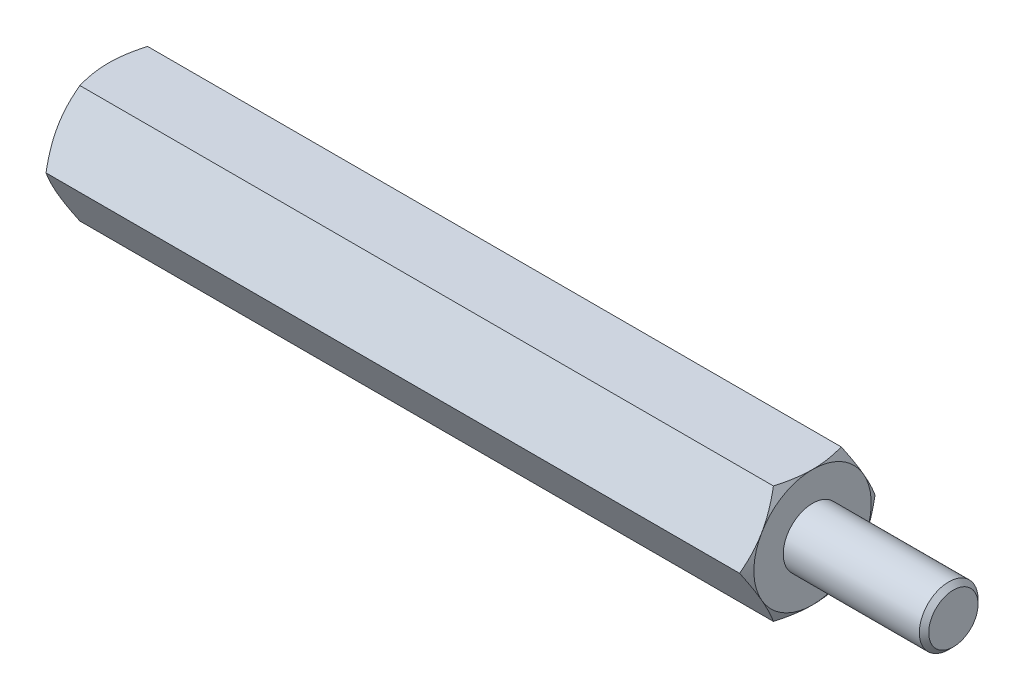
ISO-10303-21;
HEADER;
FILE_DESCRIPTION(('STEP AP214'),'2;1');
FILE_NAME('part.step','',(''),(''),'','','');
FILE_SCHEMA(('AUTOMOTIVE_DESIGN { 1 0 10303 214 1 1 1 1 }'));
ENDSEC;
DATA;
#1=APPLICATION_CONTEXT('core data for automotive mechanical design processes');
#2=APPLICATION_PROTOCOL_DEFINITION('international standard','automotive_design',2000,#1);
#3=PRODUCT_CONTEXT('',#1,'mechanical');
#4=PRODUCT('Part','Part','',(#3));
#5=PRODUCT_RELATED_PRODUCT_CATEGORY('part','',(#4));
#6=PRODUCT_DEFINITION_FORMATION('','',#4);
#7=PRODUCT_DEFINITION_CONTEXT('part definition',#1,'design');
#8=PRODUCT_DEFINITION('design','',#6,#7);
#9=PRODUCT_DEFINITION_SHAPE('','',#8);
#10=(LENGTH_UNIT() NAMED_UNIT(*) SI_UNIT(.MILLI.,.METRE.));
#11=(NAMED_UNIT(*) PLANE_ANGLE_UNIT() SI_UNIT($,.RADIAN.));
#12=(NAMED_UNIT(*) SI_UNIT($,.STERADIAN.) SOLID_ANGLE_UNIT());
#13=UNCERTAINTY_MEASURE_WITH_UNIT(LENGTH_MEASURE(1.E-05),#10,'distance_accuracy_value','');
#14=(GEOMETRIC_REPRESENTATION_CONTEXT(3) GLOBAL_UNCERTAINTY_ASSIGNED_CONTEXT((#13)) GLOBAL_UNIT_ASSIGNED_CONTEXT((#10,
#11,#12)) REPRESENTATION_CONTEXT('',''));
#15=CARTESIAN_POINT('',(0.,0.,0.));
#16=DIRECTION('',(0.,0.,1.));
#17=DIRECTION('',(1.,0.,0.));
#18=AXIS2_PLACEMENT_3D('',#15,#16,#17);
#19=CARTESIAN_POINT('',(15.,2.5,-1.44337567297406));
#20=DIRECTION('',(1.,0.,0.));
#21=DIRECTION('',(0.,0.,-1.));
#22=AXIS2_PLACEMENT_3D('',#19,#20,#21);
#23=PLANE('',#22);
#24=CARTESIAN_POINT('',(15.,0.,0.));
#25=DIRECTION('',(1.,0.,0.));
#26=DIRECTION('',(0.,0.,-1.));
#27=AXIS2_PLACEMENT_3D('',#24,#25,#26);
#28=CIRCLE('',#27,2.5);
#29=CARTESIAN_POINT('',(15.,-1.25,-2.1650635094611));
#30=VERTEX_POINT('',#29);
#31=CARTESIAN_POINT('',(15.,1.25,-2.1650635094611));
#32=VERTEX_POINT('',#31);
#33=EDGE_CURVE('E288',#30,#32,#28,.T.);
#34=ORIENTED_EDGE('',*,*,#33,.T.);
#35=CARTESIAN_POINT('',(15.,2.5,0.));
#36=VERTEX_POINT('',#35);
#37=EDGE_CURVE('E53',#32,#36,#28,.T.);
#38=ORIENTED_EDGE('',*,*,#37,.T.);
#39=CARTESIAN_POINT('',(15.,1.25,2.1650635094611));
#40=VERTEX_POINT('',#39);
#41=EDGE_CURVE('E297',#36,#40,#28,.T.);
#42=ORIENTED_EDGE('',*,*,#41,.T.);
#43=CARTESIAN_POINT('',(15.,-1.25000000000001,2.1650635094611));
#44=VERTEX_POINT('',#43);
#45=EDGE_CURVE('E302',#40,#44,#28,.T.);
#46=ORIENTED_EDGE('',*,*,#45,.T.);
#47=CARTESIAN_POINT('',(15.,0.,0.));
#48=DIRECTION('',(-1.,0.,0.));
#49=DIRECTION('',(0.,-1.,0.));
#50=AXIS2_PLACEMENT_3D('',#47,#48,#49);
#51=CIRCLE('',#50,2.5);
#52=CARTESIAN_POINT('',(15.,-2.50000000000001,0.));
#53=VERTEX_POINT('',#52);
#54=EDGE_CURVE('E193',#53,#44,#51,.T.);
#55=ORIENTED_EDGE('',*,*,#54,.F.);
#56=EDGE_CURVE('E61',#53,#30,#28,.T.);
#57=ORIENTED_EDGE('',*,*,#56,.T.);
#58=EDGE_LOOP('',(#34,#38,#42,#46,#55,#57));
#59=FACE_BOUND('',#58,.T.);
#60=CARTESIAN_POINT('',(15.,0.,0.));
#61=DIRECTION('',(1.,0.,0.));
#62=DIRECTION('',(0.,0.,-1.));
#63=AXIS2_PLACEMENT_3D('',#60,#61,#62);
#64=CIRCLE('',#63,1.25);
#65=CARTESIAN_POINT('',(15.,0.,-1.25));
#66=VERTEX_POINT('',#65);
#67=EDGE_CURVE('E319',#66,#66,#64,.T.);
#68=ORIENTED_EDGE('',*,*,#67,.F.);
#69=EDGE_LOOP('',(#68));
#70=FACE_BOUND('',#69,.T.);
#71=ADVANCED_FACE('F37',(#59,#70),#23,.T.);
#72=CARTESIAN_POINT('',(15.,0.,-2.88675134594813));
#73=DIRECTION('',(0.,-0.5,0.866025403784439));
#74=DIRECTION('',(0.,-0.866025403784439,-0.5));
#75=AXIS2_PLACEMENT_3D('',#72,#73,#74);
#76=PLANE('',#75);
#77=CARTESIAN_POINT('',(14.7766423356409,-0.000199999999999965,-2.88686681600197));
#78=CARTESIAN_POINT('',(14.8132783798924,0.109663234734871,-2.82343724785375));
#79=CARTESIAN_POINT('',(14.8465977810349,0.220474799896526,-2.75946016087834));
#80=CARTESIAN_POINT('',(14.9047577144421,0.444016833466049,-2.63039810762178));
#81=CARTESIAN_POINT('',(14.9295776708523,0.556751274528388,-2.5653108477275));
#82=CARTESIAN_POINT('',(14.968214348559,0.780822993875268,-2.43594298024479));
#83=CARTESIAN_POINT('',(14.9822882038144,0.892125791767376,-2.37168227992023));
#84=CARTESIAN_POINT('',(14.9990908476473,1.11525522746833,-2.24285844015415));
#85=CARTESIAN_POINT('',(15.0018335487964,1.22708105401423,-2.17829576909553));
#86=CARTESIAN_POINT('',(14.9961342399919,1.43604197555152,-2.05765212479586));
#87=CARTESIAN_POINT('',(14.9890916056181,1.53320831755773,-2.0015531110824));
#88=CARTESIAN_POINT('',(14.9667685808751,1.726907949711,-1.88972057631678));
#89=CARTESIAN_POINT('',(14.9514805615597,1.82344056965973,-1.8339874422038));
#90=CARTESIAN_POINT('',(14.9132609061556,2.01753972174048,-1.7219242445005));
#91=CARTESIAN_POINT('',(14.8901672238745,2.11508168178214,-1.66560836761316));
#92=CARTESIAN_POINT('',(14.8377533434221,2.30871060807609,-1.55381665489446));
#93=CARTESIAN_POINT('',(14.8084454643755,2.40480005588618,-1.49833938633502));
#94=CARTESIAN_POINT('',(14.7766423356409,2.5002,-1.44326020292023));
#95=B_SPLINE_CURVE_WITH_KNOTS('',3,(#77,#78,#79,#80,#81,#82,#83,#84,#85,#86,#87,#88,#89,#90,#91,
#92,#93,#94),.UNSPECIFIED.,.F.,.F.,(4,2,2,2,2,2,2,2,4),(0.,0.396285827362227,0.79352433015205,
1.18093086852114,1.56786160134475,1.90479741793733,2.24204551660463,2.58677531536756,
2.93082800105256),.UNSPECIFIED.);
#96=CARTESIAN_POINT('',(14.7767090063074,0.,-2.88675134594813));
#97=VERTEX_POINT('',#96);
#98=EDGE_CURVE('E328',#97,#32,#95,.T.);
#99=ORIENTED_EDGE('',*,*,#98,.F.);
#100=DIRECTION('',(-1.,0.,0.));
#101=VECTOR('',#100,1.);
#102=CARTESIAN_POINT('',(15.,0.,-2.88675134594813));
#103=LINE('',#102,#101);
#104=CARTESIAN_POINT('',(-14.7767090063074,0.,-2.88675134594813));
#105=VERTEX_POINT('',#104);
#106=EDGE_CURVE('E264',#97,#105,#103,.T.);
#107=ORIENTED_EDGE('',*,*,#106,.T.);
#108=CARTESIAN_POINT('',(-14.7766423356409,2.5002,-1.44326020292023));
#109=CARTESIAN_POINT('',(-14.8132783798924,2.39033676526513,-1.50668977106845));
#110=CARTESIAN_POINT('',(-14.8465977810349,2.27952520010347,-1.57066685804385));
#111=CARTESIAN_POINT('',(-14.9047577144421,2.05598316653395,-1.69972891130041));
#112=CARTESIAN_POINT('',(-14.9295776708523,1.94324872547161,-1.7648161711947));
#113=CARTESIAN_POINT('',(-14.968214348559,1.71917700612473,-1.8941840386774));
#114=CARTESIAN_POINT('',(-14.9822882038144,1.60787420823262,-1.95844473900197));
#115=CARTESIAN_POINT('',(-14.9990908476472,1.38474477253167,-2.08726857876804));
#116=CARTESIAN_POINT('',(-15.0018335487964,1.27291894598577,-2.15183124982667));
#117=CARTESIAN_POINT('',(-14.9961342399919,1.06395802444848,-2.27247489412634));
#118=CARTESIAN_POINT('',(-14.9890916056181,0.96679168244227,-2.32857390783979));
#119=CARTESIAN_POINT('',(-14.9667685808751,0.773092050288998,-2.44040644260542));
#120=CARTESIAN_POINT('',(-14.9514805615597,0.676559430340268,-2.49613957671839));
#121=CARTESIAN_POINT('',(-14.9132609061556,0.482460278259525,-2.60820277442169));
#122=CARTESIAN_POINT('',(-14.8901672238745,0.38491831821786,-2.66451865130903));
#123=CARTESIAN_POINT('',(-14.8377533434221,0.191289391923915,-2.77631036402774));
#124=CARTESIAN_POINT('',(-14.8084454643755,0.0951999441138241,-2.83178763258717));
#125=CARTESIAN_POINT('',(-14.7766423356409,-0.000199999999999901,-2.88686681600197));
#126=B_SPLINE_CURVE_WITH_KNOTS('',3,(#108,#109,#110,#111,#112,#113,#114,#115,#116,#117,#118,
#119,#120,#121,#122,#123,#124,#125),.UNSPECIFIED.,.F.,.F.,(4,2,2,2,2,2,2,2,4),(0.,
0.396285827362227,0.79352433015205,1.18093086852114,1.56786160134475,1.90479741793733,
2.24204551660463,2.58677531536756,2.93082800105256),.UNSPECIFIED.);
#127=CARTESIAN_POINT('',(-15.,1.25,-2.1650635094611));
#128=VERTEX_POINT('',#127);
#129=EDGE_CURVE('E363',#128,#105,#126,.T.);
#130=ORIENTED_EDGE('',*,*,#129,.F.);
#131=CARTESIAN_POINT('',(-14.7767090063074,2.5,-1.44337567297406));
#132=VERTEX_POINT('',#131);
#133=EDGE_CURVE('E359',#132,#128,#126,.T.);
#134=ORIENTED_EDGE('',*,*,#133,.F.);
#135=DIRECTION('',(-1.,0.,0.));
#136=VECTOR('',#135,1.);
#137=CARTESIAN_POINT('',(15.,2.5,-1.44337567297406));
#138=LINE('',#137,#136);
#139=CARTESIAN_POINT('',(14.7767090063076,2.5,-1.44337567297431));
#140=VERTEX_POINT('',#139);
#141=EDGE_CURVE('E279',#140,#132,#138,.T.);
#142=ORIENTED_EDGE('',*,*,#141,.F.);
#143=EDGE_CURVE('E229',#32,#140,#95,.T.);
#144=ORIENTED_EDGE('',*,*,#143,.F.);
#145=EDGE_LOOP('',(#99,#107,#130,#134,#142,#144));
#146=FACE_BOUND('',#145,.T.);
#147=ADVANCED_FACE('F148',(#146),#76,.F.);
#148=CARTESIAN_POINT('',(15.,2.5,-1.44337567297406));
#149=DIRECTION('',(0.,-1.,0.));
#150=DIRECTION('',(0.,0.,-1.));
#151=AXIS2_PLACEMENT_3D('',#148,#149,#150);
#152=PLANE('',#151);
#153=CARTESIAN_POINT('',(13.7680338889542,2.5,-3.90158441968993));
#154=CARTESIAN_POINT('',(13.8212077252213,2.5,-3.79217004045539));
#155=CARTESIAN_POINT('',(13.8738786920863,2.5,-3.68250707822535));
#156=CARTESIAN_POINT('',(13.9779324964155,2.5,-3.46255185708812));
#157=CARTESIAN_POINT('',(14.0293151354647,2.5,-3.35225950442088));
#158=CARTESIAN_POINT('',(14.1307630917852,2.5,-3.13035696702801));
#159=CARTESIAN_POINT('',(14.1808199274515,2.5,-3.0187428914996));
#160=CARTESIAN_POINT('',(14.2789171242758,2.5,-2.79463535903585));
#161=CARTESIAN_POINT('',(14.3269575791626,2.5,-2.68214194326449));
#162=CARTESIAN_POINT('',(14.4220184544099,2.5,-2.45240385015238));
#163=CARTESIAN_POINT('',(14.4689543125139,2.5,-2.33512399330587));
#164=CARTESIAN_POINT('',(14.5593326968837,2.5,-2.09920133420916));
#165=CARTESIAN_POINT('',(14.6027748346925,2.5,-1.98055838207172));
#166=CARTESIAN_POINT('',(14.6850435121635,2.5,-1.74193489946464));
#167=CARTESIAN_POINT('',(14.7238791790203,2.5,-1.6219575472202));
#168=CARTESIAN_POINT('',(14.7957050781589,2.5,-1.38028205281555));
#169=CARTESIAN_POINT('',(14.8286971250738,2.5,-1.25858445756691));
#170=CARTESIAN_POINT('',(14.8870959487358,2.5,-1.01406369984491));
#171=CARTESIAN_POINT('',(14.9125437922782,2.5,-0.891250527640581));
#172=CARTESIAN_POINT('',(14.9544275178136,2.5,-0.64407172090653));
#173=CARTESIAN_POINT('',(14.9708643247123,2.5,-0.519706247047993));
#174=CARTESIAN_POINT('',(14.9932006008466,2.5,-0.271679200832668));
#175=CARTESIAN_POINT('',(14.9992375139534,2.5,-0.148030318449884));
#176=CARTESIAN_POINT('',(15.0006256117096,2.5,0.099339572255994));
#177=CARTESIAN_POINT('',(14.9959765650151,2.5,0.223060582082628));
#178=CARTESIAN_POINT('',(14.9794044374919,2.5,0.432351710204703));
#179=CARTESIAN_POINT('',(14.9701066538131,2.5,0.518143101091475));
#180=CARTESIAN_POINT('',(14.9469384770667,2.5,0.689112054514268));
#181=CARTESIAN_POINT('',(14.9330674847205,2.5,0.774289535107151));
#182=CARTESIAN_POINT('',(14.8853202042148,2.5,1.02876599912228));
#183=CARTESIAN_POINT('',(14.8453176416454,2.5,1.19691958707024));
#184=CARTESIAN_POINT('',(14.7522656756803,2.5,1.53362893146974));
#185=CARTESIAN_POINT('',(14.6989362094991,2.5,1.70210423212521));
#186=CARTESIAN_POINT('',(14.6123716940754,2.5,1.95247339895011));
#187=CARTESIAN_POINT('',(14.5824247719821,2.5,2.03553184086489));
#188=CARTESIAN_POINT('',(14.5206840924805,2.5,2.20095860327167));
#189=CARTESIAN_POINT('',(14.4888903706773,2.5,2.2833269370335));
#190=CARTESIAN_POINT('',(14.404014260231,2.5,2.49723312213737));
#191=CARTESIAN_POINT('',(14.3497173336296,2.5,2.6282879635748));
#192=CARTESIAN_POINT('',(14.2381273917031,2.5,2.88912034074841));
#193=CARTESIAN_POINT('',(14.1808341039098,2.5,3.01889775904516));
#194=CARTESIAN_POINT('',(14.0639348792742,2.5,3.27745045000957));
#195=CARTESIAN_POINT('',(14.004328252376,2.5,3.40622540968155));
#196=CARTESIAN_POINT('',(13.8833234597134,2.5,3.66293235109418));
#197=CARTESIAN_POINT('',(13.821925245,2.5,3.79086430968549));
#198=CARTESIAN_POINT('',(13.6354580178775,2.5,4.17399495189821));
#199=CARTESIAN_POINT('',(13.5082824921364,2.5,4.42816724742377));
#200=CARTESIAN_POINT('',(13.2503455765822,2.5,4.93461464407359));
#201=CARTESIAN_POINT('',(13.1195848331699,2.5,5.18689007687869));
#202=CARTESIAN_POINT('',(12.8687100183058,2.5,5.66512451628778));
#203=CARTESIAN_POINT('',(12.7488298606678,2.5,5.89120644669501));
#204=CARTESIAN_POINT('',(12.5075902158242,2.5,6.34259369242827));
#205=CARTESIAN_POINT('',(12.3862306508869,2.5,6.56789896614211));
#206=CARTESIAN_POINT('',(12.142780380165,2.5,7.01722044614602));
#207=CARTESIAN_POINT('',(12.0206930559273,2.5,7.24123848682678));
#208=CARTESIAN_POINT('',(11.7756662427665,2.5,7.68878772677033));
#209=CARTESIAN_POINT('',(11.652726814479,2.5,7.9123189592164));
#210=CARTESIAN_POINT('',(11.5294756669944,2.5,8.13567697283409));
#211=B_SPLINE_CURVE_WITH_KNOTS('',3,(#153,#154,#155,#156,#157,#158,#159,#160,#161,#162,#163,
#164,#165,#166,#167,#168,#169,#170,#171,#172,#173,#174,#175,#176,#177,#178,#179,#180,#181,#182,
#183,#184,#185,#186,#187,#188,#189,#190,#191,#192,#193,#194,#195,#196,#197,#198,#199,#200,#201,
#202,#203,#204,#205,#206,#207,#208,#209,#210),.UNSPECIFIED.,.F.,.F.,(4,2,2,2,2,2,2,2,2,2,2,2,2,
2,2,2,2,2,2,2,2,2,2,2,2,2,2,2,4),(0.,0.364957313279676,0.729970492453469,1.09692930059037,
1.46387103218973,1.84279746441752,2.22176597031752,2.59997058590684,2.97805755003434,
3.3540469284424,3.72999770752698,4.10094071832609,4.47189175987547,4.73064905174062,
4.98944026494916,5.5072907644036,6.03710483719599,6.30196454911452,6.56681915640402,
6.99233818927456,7.41789598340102,7.84358170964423,8.26927907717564,9.12186602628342,
9.9743002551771,10.7419897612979,11.5097197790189,12.2750964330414,13.0404191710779),.UNSPECIFIED.);
#212=EDGE_CURVE('E227',#140,#36,#211,.T.);
#213=ORIENTED_EDGE('',*,*,#212,.F.);
#214=ORIENTED_EDGE('',*,*,#141,.T.);
#215=CARTESIAN_POINT('',(-13.7680338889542,2.5,-3.90158441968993));
#216=CARTESIAN_POINT('',(-13.8212077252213,2.5,-3.79217004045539));
#217=CARTESIAN_POINT('',(-13.8738786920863,2.5,-3.68250707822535));
#218=CARTESIAN_POINT('',(-13.9779324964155,2.5,-3.46255185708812));
#219=CARTESIAN_POINT('',(-14.0293151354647,2.5,-3.35225950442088));
#220=CARTESIAN_POINT('',(-14.1307630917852,2.5,-3.13035696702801));
#221=CARTESIAN_POINT('',(-14.1808199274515,2.5,-3.0187428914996));
#222=CARTESIAN_POINT('',(-14.2789171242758,2.5,-2.79463535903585));
#223=CARTESIAN_POINT('',(-14.3269575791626,2.5,-2.68214194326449));
#224=CARTESIAN_POINT('',(-14.4220184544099,2.5,-2.45240385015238));
#225=CARTESIAN_POINT('',(-14.4689543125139,2.5,-2.33512399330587));
#226=CARTESIAN_POINT('',(-14.5593326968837,2.5,-2.09920133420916));
#227=CARTESIAN_POINT('',(-14.6027748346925,2.5,-1.98055838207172));
#228=CARTESIAN_POINT('',(-14.6850435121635,2.5,-1.74193489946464));
#229=CARTESIAN_POINT('',(-14.7238791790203,2.5,-1.6219575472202));
#230=CARTESIAN_POINT('',(-14.7957050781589,2.5,-1.38028205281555));
#231=CARTESIAN_POINT('',(-14.8286971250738,2.5,-1.25858445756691));
#232=CARTESIAN_POINT('',(-14.8870959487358,2.5,-1.01406369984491));
#233=CARTESIAN_POINT('',(-14.9125437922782,2.5,-0.891250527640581));
#234=CARTESIAN_POINT('',(-14.9544275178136,2.5,-0.64407172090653));
#235=CARTESIAN_POINT('',(-14.9708643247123,2.5,-0.519706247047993));
#236=CARTESIAN_POINT('',(-14.9932006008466,2.5,-0.271679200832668));
#237=CARTESIAN_POINT('',(-14.9992375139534,2.5,-0.148030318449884));
#238=CARTESIAN_POINT('',(-15.0006256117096,2.5,0.099339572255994));
#239=CARTESIAN_POINT('',(-14.9959765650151,2.5,0.223060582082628));
#240=CARTESIAN_POINT('',(-14.9794044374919,2.5,0.432351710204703));
#241=CARTESIAN_POINT('',(-14.9701066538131,2.5,0.518143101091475));
#242=CARTESIAN_POINT('',(-14.9469384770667,2.5,0.689112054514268));
#243=CARTESIAN_POINT('',(-14.9330674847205,2.5,0.774289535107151));
#244=CARTESIAN_POINT('',(-14.8853202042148,2.5,1.02876599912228));
#245=CARTESIAN_POINT('',(-14.8453176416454,2.5,1.19691958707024));
#246=CARTESIAN_POINT('',(-14.7522656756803,2.5,1.53362893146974));
#247=CARTESIAN_POINT('',(-14.6989362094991,2.5,1.70210423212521));
#248=CARTESIAN_POINT('',(-14.6123716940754,2.5,1.95247339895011));
#249=CARTESIAN_POINT('',(-14.5824247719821,2.5,2.03553184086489));
#250=CARTESIAN_POINT('',(-14.5206840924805,2.5,2.20095860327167));
#251=CARTESIAN_POINT('',(-14.4888903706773,2.5,2.2833269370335));
#252=CARTESIAN_POINT('',(-14.404014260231,2.5,2.49723312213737));
#253=CARTESIAN_POINT('',(-14.3497173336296,2.5,2.6282879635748));
#254=CARTESIAN_POINT('',(-14.2381273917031,2.5,2.88912034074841));
#255=CARTESIAN_POINT('',(-14.1808341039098,2.5,3.01889775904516));
#256=CARTESIAN_POINT('',(-14.0639348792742,2.5,3.27745045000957));
#257=CARTESIAN_POINT('',(-14.004328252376,2.5,3.40622540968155));
#258=CARTESIAN_POINT('',(-13.8833234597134,2.5,3.66293235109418));
#259=CARTESIAN_POINT('',(-13.821925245,2.5,3.79086430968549));
#260=CARTESIAN_POINT('',(-13.6354580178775,2.5,4.17399495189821));
#261=CARTESIAN_POINT('',(-13.5082824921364,2.5,4.42816724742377));
#262=CARTESIAN_POINT('',(-13.2503455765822,2.5,4.93461464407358));
#263=CARTESIAN_POINT('',(-13.1195848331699,2.5,5.18689007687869));
#264=CARTESIAN_POINT('',(-12.8687100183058,2.5,5.66512451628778));
#265=CARTESIAN_POINT('',(-12.7488298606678,2.5,5.89120644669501));
#266=CARTESIAN_POINT('',(-12.5075902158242,2.5,6.34259369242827));
#267=CARTESIAN_POINT('',(-12.3862306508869,2.5,6.56789896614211));
#268=CARTESIAN_POINT('',(-12.142780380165,2.5,7.01722044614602));
#269=CARTESIAN_POINT('',(-12.0206930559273,2.5,7.24123848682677));
#270=CARTESIAN_POINT('',(-11.7756662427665,2.5,7.68878772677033));
#271=CARTESIAN_POINT('',(-11.652726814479,2.5,7.9123189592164));
#272=CARTESIAN_POINT('',(-11.5294756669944,2.5,8.13567697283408));
#273=B_SPLINE_CURVE_WITH_KNOTS('',3,(#215,#216,#217,#218,#219,#220,#221,#222,#223,#224,#225,
#226,#227,#228,#229,#230,#231,#232,#233,#234,#235,#236,#237,#238,#239,#240,#241,#242,#243,#244,
#245,#246,#247,#248,#249,#250,#251,#252,#253,#254,#255,#256,#257,#258,#259,#260,#261,#262,#263,
#264,#265,#266,#267,#268,#269,#270,#271,#272),.UNSPECIFIED.,.F.,.F.,(4,2,2,2,2,2,2,2,2,2,2,2,2,
2,2,2,2,2,2,2,2,2,2,2,2,2,2,2,4),(0.,0.364957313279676,0.729970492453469,1.09692930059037,
1.46387103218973,1.84279746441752,2.22176597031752,2.59997058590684,2.97805755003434,
3.3540469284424,3.72999770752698,4.10094071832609,4.47189175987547,4.73064905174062,
4.98944026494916,5.5072907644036,6.03710483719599,6.30196454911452,6.56681915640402,
6.99233818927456,7.41789598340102,7.84358170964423,8.26927907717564,9.12186602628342,
9.9743002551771,10.7419897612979,11.5097197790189,12.2750964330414,13.0404191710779),.UNSPECIFIED.);
#274=CARTESIAN_POINT('',(-15.,2.5,0.));
#275=VERTEX_POINT('',#274);
#276=EDGE_CURVE('E241',#275,#132,#273,.F.);
#277=ORIENTED_EDGE('',*,*,#276,.F.);
#278=CARTESIAN_POINT('',(-14.7767090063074,2.5,1.44337567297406));
#279=VERTEX_POINT('',#278);
#280=EDGE_CURVE('E249',#279,#275,#273,.F.);
#281=ORIENTED_EDGE('',*,*,#280,.F.);
#282=DIRECTION('',(-1.,0.,0.));
#283=VECTOR('',#282,1.);
#284=CARTESIAN_POINT('',(15.,2.5,1.44337567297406));
#285=LINE('',#284,#283);
#286=CARTESIAN_POINT('',(14.7767090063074,2.5,1.44337567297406));
#287=VERTEX_POINT('',#286);
#288=EDGE_CURVE('E276',#287,#279,#285,.T.);
#289=ORIENTED_EDGE('',*,*,#288,.F.);
#290=EDGE_CURVE('E221',#36,#287,#211,.T.);
#291=ORIENTED_EDGE('',*,*,#290,.F.);
#292=EDGE_LOOP('',(#213,#214,#277,#281,#289,#291));
#293=FACE_BOUND('',#292,.T.);
#294=ADVANCED_FACE('F153',(#293),#152,.F.);
#295=CARTESIAN_POINT('',(15.,2.5,1.44337567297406));
#296=DIRECTION('',(0.,-0.5,-0.866025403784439));
#297=DIRECTION('',(0.,0.866025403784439,-0.5));
#298=AXIS2_PLACEMENT_3D('',#295,#296,#297);
#299=PLANE('',#298);
#300=CARTESIAN_POINT('',(14.7766423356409,2.5002,1.44326020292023));
#301=CARTESIAN_POINT('',(14.8132783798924,2.39033676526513,1.50668977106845));
#302=CARTESIAN_POINT('',(14.8465977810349,2.27952520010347,1.57066685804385));
#303=CARTESIAN_POINT('',(14.9047577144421,2.05598316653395,1.69972891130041));
#304=CARTESIAN_POINT('',(14.9295776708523,1.94324872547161,1.7648161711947));
#305=CARTESIAN_POINT('',(14.968214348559,1.71917700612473,1.8941840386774));
#306=CARTESIAN_POINT('',(14.9822882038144,1.60787420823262,1.95844473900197));
#307=CARTESIAN_POINT('',(14.9990908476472,1.38474477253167,2.08726857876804));
#308=CARTESIAN_POINT('',(15.0018335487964,1.27291894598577,2.15183124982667));
#309=CARTESIAN_POINT('',(14.9961342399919,1.06395802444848,2.27247489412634));
#310=CARTESIAN_POINT('',(14.9890916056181,0.966791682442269,2.32857390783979));
#311=CARTESIAN_POINT('',(14.9667685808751,0.773092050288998,2.44040644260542));
#312=CARTESIAN_POINT('',(14.9514805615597,0.676559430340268,2.49613957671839));
#313=CARTESIAN_POINT('',(14.9132609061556,0.482460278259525,2.60820277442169));
#314=CARTESIAN_POINT('',(14.8901672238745,0.38491831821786,2.66451865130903));
#315=CARTESIAN_POINT('',(14.8377533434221,0.191289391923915,2.77631036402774));
#316=CARTESIAN_POINT('',(14.8084454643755,0.0951999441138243,2.83178763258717));
#317=CARTESIAN_POINT('',(14.7766423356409,-0.00019999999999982,2.88686681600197));
#318=B_SPLINE_CURVE_WITH_KNOTS('',3,(#300,#301,#302,#303,#304,#305,#306,#307,#308,#309,#310,
#311,#312,#313,#314,#315,#316,#317),.UNSPECIFIED.,.F.,.F.,(4,2,2,2,2,2,2,2,4),(0.,
0.396285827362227,0.79352433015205,1.18093086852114,1.56786160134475,1.90479741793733,
2.24204551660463,2.58677531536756,2.93082800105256),.UNSPECIFIED.);
#319=EDGE_CURVE('E228',#287,#40,#318,.T.);
#320=ORIENTED_EDGE('',*,*,#319,.F.);
#321=ORIENTED_EDGE('',*,*,#288,.T.);
#322=CARTESIAN_POINT('',(-14.7766423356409,-0.000199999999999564,2.88686681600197));
#323=CARTESIAN_POINT('',(-14.8132783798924,0.109663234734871,2.82343724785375));
#324=CARTESIAN_POINT('',(-14.8465977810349,0.220474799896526,2.75946016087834));
#325=CARTESIAN_POINT('',(-14.9047577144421,0.44401683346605,2.63039810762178));
#326=CARTESIAN_POINT('',(-14.9295776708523,0.556751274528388,2.5653108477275));
#327=CARTESIAN_POINT('',(-14.968214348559,0.780822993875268,2.43594298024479));
#328=CARTESIAN_POINT('',(-14.9822882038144,0.892125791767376,2.37168227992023));
#329=CARTESIAN_POINT('',(-14.9990908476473,1.11525522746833,2.24285844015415));
#330=CARTESIAN_POINT('',(-15.0018335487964,1.22708105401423,2.17829576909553));
#331=CARTESIAN_POINT('',(-14.9961342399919,1.43604197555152,2.05765212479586));
#332=CARTESIAN_POINT('',(-14.9890916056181,1.53320831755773,2.0015531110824));
#333=CARTESIAN_POINT('',(-14.9667685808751,1.726907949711,1.88972057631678));
#334=CARTESIAN_POINT('',(-14.9514805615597,1.82344056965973,1.8339874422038));
#335=CARTESIAN_POINT('',(-14.9132609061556,2.01753972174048,1.7219242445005));
#336=CARTESIAN_POINT('',(-14.8901672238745,2.11508168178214,1.66560836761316));
#337=CARTESIAN_POINT('',(-14.8377533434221,2.30871060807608,1.55381665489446));
#338=CARTESIAN_POINT('',(-14.8084454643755,2.40480005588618,1.49833938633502));
#339=CARTESIAN_POINT('',(-14.7766423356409,2.5002,1.44326020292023));
#340=B_SPLINE_CURVE_WITH_KNOTS('',3,(#322,#323,#324,#325,#326,#327,#328,#329,#330,#331,#332,
#333,#334,#335,#336,#337,#338,#339),.UNSPECIFIED.,.F.,.F.,(4,2,2,2,2,2,2,2,4),(0.,
0.396285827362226,0.79352433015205,1.18093086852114,1.56786160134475,1.90479741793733,
2.24204551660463,2.58677531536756,2.93082800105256),.UNSPECIFIED.);
#341=CARTESIAN_POINT('',(-15.,1.25,2.1650635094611));
#342=VERTEX_POINT('',#341);
#343=EDGE_CURVE('E255',#342,#279,#340,.T.);
#344=ORIENTED_EDGE('',*,*,#343,.F.);
#345=CARTESIAN_POINT('',(-14.7767090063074,0.,2.88675134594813));
#346=VERTEX_POINT('',#345);
#347=EDGE_CURVE('E262',#346,#342,#340,.T.);
#348=ORIENTED_EDGE('',*,*,#347,.F.);
#349=DIRECTION('',(-1.,0.,0.));
#350=VECTOR('',#349,1.);
#351=CARTESIAN_POINT('',(15.,0.,2.88675134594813));
#352=LINE('',#351,#350);
#353=CARTESIAN_POINT('',(14.7767090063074,0.,2.88675134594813));
#354=VERTEX_POINT('',#353);
#355=EDGE_CURVE('E273',#354,#346,#352,.T.);
#356=ORIENTED_EDGE('',*,*,#355,.F.);
#357=EDGE_CURVE('E215',#40,#354,#318,.T.);
#358=ORIENTED_EDGE('',*,*,#357,.F.);
#359=EDGE_LOOP('',(#320,#321,#344,#348,#356,#358));
#360=FACE_BOUND('',#359,.T.);
#361=ADVANCED_FACE('F235',(#360),#299,.F.);
#362=CARTESIAN_POINT('',(15.,0.,2.88675134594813));
#363=DIRECTION('',(0.,0.5,-0.866025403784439));
#364=DIRECTION('',(0.,0.866025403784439,0.5));
#365=AXIS2_PLACEMENT_3D('',#362,#363,#364);
#366=PLANE('',#365);
#367=CARTESIAN_POINT('',(14.7766423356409,0.000200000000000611,2.88686681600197));
#368=CARTESIAN_POINT('',(14.8132783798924,-0.10966323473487,2.82343724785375));
#369=CARTESIAN_POINT('',(14.8465977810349,-0.220474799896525,2.75946016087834));
#370=CARTESIAN_POINT('',(14.9047577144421,-0.444016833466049,2.63039810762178));
#371=CARTESIAN_POINT('',(14.9295776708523,-0.556751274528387,2.5653108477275));
#372=CARTESIAN_POINT('',(14.968214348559,-0.780822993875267,2.43594298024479));
#373=CARTESIAN_POINT('',(14.9822882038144,-0.892125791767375,2.37168227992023));
#374=CARTESIAN_POINT('',(14.9990908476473,-1.11525522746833,2.24285844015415));
#375=CARTESIAN_POINT('',(15.0018335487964,-1.22708105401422,2.17829576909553));
#376=CARTESIAN_POINT('',(14.9961342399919,-1.43604197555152,2.05765212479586));
#377=CARTESIAN_POINT('',(14.9890916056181,-1.53320831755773,2.0015531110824));
#378=CARTESIAN_POINT('',(14.9667685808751,-1.726907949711,1.88972057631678));
#379=CARTESIAN_POINT('',(14.9514805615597,-1.82344056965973,1.8339874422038));
#380=CARTESIAN_POINT('',(14.9132609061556,-2.01753972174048,1.7219242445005));
#381=CARTESIAN_POINT('',(14.8901672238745,-2.11508168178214,1.66560836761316));
#382=CARTESIAN_POINT('',(14.8377533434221,-2.30871060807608,1.55381665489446));
#383=CARTESIAN_POINT('',(14.8084454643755,-2.40480005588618,1.49833938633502));
#384=CARTESIAN_POINT('',(14.7766423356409,-2.5002,1.44326020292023));
#385=B_SPLINE_CURVE_WITH_KNOTS('',3,(#367,#368,#369,#370,#371,#372,#373,#374,#375,#376,#377,
#378,#379,#380,#381,#382,#383,#384),.UNSPECIFIED.,.F.,.F.,(4,2,2,2,2,2,2,2,4),(0.,
0.396285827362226,0.79352433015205,1.18093086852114,1.56786160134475,1.90479741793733,
2.24204551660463,2.58677531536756,2.93082800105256),.UNSPECIFIED.);
#386=EDGE_CURVE('E385',#354,#44,#385,.T.);
#387=ORIENTED_EDGE('',*,*,#386,.F.);
#388=ORIENTED_EDGE('',*,*,#355,.T.);
#389=CARTESIAN_POINT('',(-14.7766423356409,-2.5002,1.44326020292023));
#390=CARTESIAN_POINT('',(-14.8132783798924,-2.39033676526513,1.50668977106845));
#391=CARTESIAN_POINT('',(-14.8465977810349,-2.27952520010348,1.57066685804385));
#392=CARTESIAN_POINT('',(-14.9047577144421,-2.05598316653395,1.69972891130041));
#393=CARTESIAN_POINT('',(-14.9295776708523,-1.94324872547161,1.7648161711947));
#394=CARTESIAN_POINT('',(-14.968214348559,-1.71917700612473,1.8941840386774));
#395=CARTESIAN_POINT('',(-14.9822882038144,-1.60787420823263,1.95844473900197));
#396=CARTESIAN_POINT('',(-14.9990908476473,-1.38474477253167,2.08726857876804));
#397=CARTESIAN_POINT('',(-15.0018335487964,-1.27291894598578,2.15183124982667));
#398=CARTESIAN_POINT('',(-14.9961342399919,-1.06395802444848,2.27247489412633));
#399=CARTESIAN_POINT('',(-14.9890916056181,-0.966791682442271,2.32857390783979));
#400=CARTESIAN_POINT('',(-14.9667685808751,-0.773092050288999,2.44040644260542));
#401=CARTESIAN_POINT('',(-14.9514805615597,-0.676559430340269,2.49613957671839));
#402=CARTESIAN_POINT('',(-14.9132609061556,-0.482460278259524,2.60820277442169));
#403=CARTESIAN_POINT('',(-14.8901672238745,-0.384918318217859,2.66451865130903));
#404=CARTESIAN_POINT('',(-14.8377533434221,-0.191289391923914,2.77631036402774));
#405=CARTESIAN_POINT('',(-14.8084454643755,-0.0951999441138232,2.83178763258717));
#406=CARTESIAN_POINT('',(-14.7766423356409,0.000200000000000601,2.88686681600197));
#407=B_SPLINE_CURVE_WITH_KNOTS('',3,(#389,#390,#391,#392,#393,#394,#395,#396,#397,#398,#399,
#400,#401,#402,#403,#404,#405,#406),.UNSPECIFIED.,.F.,.F.,(4,2,2,2,2,2,2,2,4),(0.,
0.396285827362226,0.793524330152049,1.18093086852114,1.56786160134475,1.90479741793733,
2.24204551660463,2.58677531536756,2.93082800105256),.UNSPECIFIED.);
#408=CARTESIAN_POINT('',(-15.,-1.25000000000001,2.1650635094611));
#409=VERTEX_POINT('',#408);
#410=EDGE_CURVE('E263',#409,#346,#407,.T.);
#411=ORIENTED_EDGE('',*,*,#410,.F.);
#412=CARTESIAN_POINT('',(-14.7767090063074,-2.5,1.44337567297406));
#413=VERTEX_POINT('',#412);
#414=EDGE_CURVE('E250',#413,#409,#407,.T.);
#415=ORIENTED_EDGE('',*,*,#414,.F.);
#416=DIRECTION('',(-1.,0.,0.));
#417=VECTOR('',#416,1.);
#418=CARTESIAN_POINT('',(15.,-2.5,1.44337567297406));
#419=LINE('',#418,#417);
#420=CARTESIAN_POINT('',(14.7767090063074,-2.5,1.44337567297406));
#421=VERTEX_POINT('',#420);
#422=EDGE_CURVE('E270',#421,#413,#419,.T.);
#423=ORIENTED_EDGE('',*,*,#422,.F.);
#424=EDGE_CURVE('E210',#44,#421,#385,.T.);
#425=ORIENTED_EDGE('',*,*,#424,.F.);
#426=EDGE_LOOP('',(#387,#388,#411,#415,#423,#425));
#427=FACE_BOUND('',#426,.T.);
#428=ADVANCED_FACE('F351',(#427),#366,.F.);
#429=CARTESIAN_POINT('',(15.,-2.5,1.44337567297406));
#430=DIRECTION('',(0.,1.,0.));
#431=DIRECTION('',(0.,0.,1.));
#432=AXIS2_PLACEMENT_3D('',#429,#430,#431);
#433=PLANE('',#432);
#434=CARTESIAN_POINT('',(13.7680338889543,-2.5,-3.90158441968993));
#435=CARTESIAN_POINT('',(13.8212077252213,-2.5,-3.79217004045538));
#436=CARTESIAN_POINT('',(13.8738786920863,-2.5,-3.68250707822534));
#437=CARTESIAN_POINT('',(13.9779324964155,-2.5,-3.46255185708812));
#438=CARTESIAN_POINT('',(14.0293151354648,-2.5,-3.35225950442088));
#439=CARTESIAN_POINT('',(14.1307630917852,-2.5,-3.130356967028));
#440=CARTESIAN_POINT('',(14.1808199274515,-2.5,-3.01874289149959));
#441=CARTESIAN_POINT('',(14.2789171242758,-2.5,-2.79463535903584));
#442=CARTESIAN_POINT('',(14.3269575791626,-2.5,-2.68214194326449));
#443=CARTESIAN_POINT('',(14.4220184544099,-2.5,-2.45240385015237));
#444=CARTESIAN_POINT('',(14.4689543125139,-2.5,-2.33512399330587));
#445=CARTESIAN_POINT('',(14.5593326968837,-2.5,-2.09920133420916));
#446=CARTESIAN_POINT('',(14.6027748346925,-2.5,-1.98055838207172));
#447=CARTESIAN_POINT('',(14.6850435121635,-2.5,-1.74193489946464));
#448=CARTESIAN_POINT('',(14.7238791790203,-2.5,-1.6219575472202));
#449=CARTESIAN_POINT('',(14.7957050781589,-2.5,-1.38028205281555));
#450=CARTESIAN_POINT('',(14.8286971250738,-2.5,-1.25858445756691));
#451=CARTESIAN_POINT('',(14.8870959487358,-2.5,-1.01406369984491));
#452=CARTESIAN_POINT('',(14.9125437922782,-2.5,-0.891250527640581));
#453=CARTESIAN_POINT('',(14.9544275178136,-2.5,-0.644071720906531));
#454=CARTESIAN_POINT('',(14.9708643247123,-2.5,-0.519706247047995));
#455=CARTESIAN_POINT('',(14.9932006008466,-2.5,-0.27167920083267));
#456=CARTESIAN_POINT('',(14.9992375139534,-2.5,-0.148030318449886));
#457=CARTESIAN_POINT('',(15.0006256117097,-2.5,0.0993395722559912));
#458=CARTESIAN_POINT('',(14.9959765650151,-2.5,0.223060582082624));
#459=CARTESIAN_POINT('',(14.9794044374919,-2.5,0.432351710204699));
#460=CARTESIAN_POINT('',(14.9701066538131,-2.5,0.518143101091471));
#461=CARTESIAN_POINT('',(14.9469384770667,-2.5,0.689112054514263));
#462=CARTESIAN_POINT('',(14.9330674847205,-2.5,0.774289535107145));
#463=CARTESIAN_POINT('',(14.8853202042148,-2.5,1.02876599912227));
#464=CARTESIAN_POINT('',(14.8453176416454,-2.5,1.19691958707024));
#465=CARTESIAN_POINT('',(14.7522656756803,-2.5,1.53362893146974));
#466=CARTESIAN_POINT('',(14.6989362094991,-2.5,1.70210423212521));
#467=CARTESIAN_POINT('',(14.6123716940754,-2.5,1.95247339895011));
#468=CARTESIAN_POINT('',(14.5824247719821,-2.5,2.03553184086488));
#469=CARTESIAN_POINT('',(14.5206840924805,-2.5,2.20095860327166));
#470=CARTESIAN_POINT('',(14.4888903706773,-2.5,2.28332693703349));
#471=CARTESIAN_POINT('',(14.404014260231,-2.5,2.49723312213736));
#472=CARTESIAN_POINT('',(14.3497173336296,-2.5,2.62828796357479));
#473=CARTESIAN_POINT('',(14.2381273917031,-2.5,2.8891203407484));
#474=CARTESIAN_POINT('',(14.1808341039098,-2.5,3.01889775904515));
#475=CARTESIAN_POINT('',(14.0639348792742,-2.5,3.27745045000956));
#476=CARTESIAN_POINT('',(14.004328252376,-2.5,3.40622540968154));
#477=CARTESIAN_POINT('',(13.8833234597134,-2.5,3.66293235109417));
#478=CARTESIAN_POINT('',(13.821925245,-2.5,3.79086430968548));
#479=CARTESIAN_POINT('',(13.6354580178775,-2.5,4.1739949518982));
#480=CARTESIAN_POINT('',(13.5082824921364,-2.5,4.42816724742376));
#481=CARTESIAN_POINT('',(13.2503455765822,-2.5,4.93461464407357));
#482=CARTESIAN_POINT('',(13.1195848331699,-2.5,5.18689007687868));
#483=CARTESIAN_POINT('',(12.8687100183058,-2.5,5.66512451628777));
#484=CARTESIAN_POINT('',(12.7488298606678,-2.5,5.891206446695));
#485=CARTESIAN_POINT('',(12.5075902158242,-2.5,6.34259369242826));
#486=CARTESIAN_POINT('',(12.3862306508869,-2.5,6.5678989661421));
#487=CARTESIAN_POINT('',(12.142780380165,-2.5,7.01722044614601));
#488=CARTESIAN_POINT('',(12.0206930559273,-2.5,7.24123848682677));
#489=CARTESIAN_POINT('',(11.7756662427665,-2.5,7.68878772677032));
#490=CARTESIAN_POINT('',(11.652726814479,-2.5,7.91231895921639));
#491=CARTESIAN_POINT('',(11.5294756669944,-2.5,8.13567697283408));
#492=B_SPLINE_CURVE_WITH_KNOTS('',3,(#434,#435,#436,#437,#438,#439,#440,#441,#442,#443,#444,
#445,#446,#447,#448,#449,#450,#451,#452,#453,#454,#455,#456,#457,#458,#459,#460,#461,#462,#463,
#464,#465,#466,#467,#468,#469,#470,#471,#472,#473,#474,#475,#476,#477,#478,#479,#480,#481,#482,
#483,#484,#485,#486,#487,#488,#489,#490,#491),.UNSPECIFIED.,.F.,.F.,(4,2,2,2,2,2,2,2,2,2,2,2,2,
2,2,2,2,2,2,2,2,2,2,2,2,2,2,2,4),(0.,0.364957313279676,0.729970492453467,1.09692930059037,
1.46387103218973,1.84279746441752,2.22176597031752,2.59997058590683,2.97805755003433,
3.35404692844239,3.72999770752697,4.10094071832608,4.47189175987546,4.73064905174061,
4.98944026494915,5.50729076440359,6.03710483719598,6.30196454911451,6.56681915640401,
6.99233818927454,7.417895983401,7.84358170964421,8.26927907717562,9.1218660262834,
9.97430025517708,10.7419897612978,11.5097197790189,12.2750964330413,13.0404191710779),.UNSPECIFIED.);
#493=EDGE_CURVE('E384',#421,#53,#492,.F.);
#494=ORIENTED_EDGE('',*,*,#493,.F.);
#495=ORIENTED_EDGE('',*,*,#422,.T.);
#496=CARTESIAN_POINT('',(-13.7680338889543,-2.5,-3.90158441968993));
#497=CARTESIAN_POINT('',(-13.8212077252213,-2.5,-3.79217004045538));
#498=CARTESIAN_POINT('',(-13.8738786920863,-2.5,-3.68250707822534));
#499=CARTESIAN_POINT('',(-13.9779324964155,-2.5,-3.46255185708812));
#500=CARTESIAN_POINT('',(-14.0293151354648,-2.5,-3.35225950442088));
#501=CARTESIAN_POINT('',(-14.1307630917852,-2.5,-3.130356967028));
#502=CARTESIAN_POINT('',(-14.1808199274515,-2.5,-3.01874289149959));
#503=CARTESIAN_POINT('',(-14.2789171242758,-2.5,-2.79463535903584));
#504=CARTESIAN_POINT('',(-14.3269575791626,-2.5,-2.68214194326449));
#505=CARTESIAN_POINT('',(-14.4220184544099,-2.5,-2.45240385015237));
#506=CARTESIAN_POINT('',(-14.4689543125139,-2.5,-2.33512399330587));
#507=CARTESIAN_POINT('',(-14.5593326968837,-2.5,-2.09920133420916));
#508=CARTESIAN_POINT('',(-14.6027748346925,-2.5,-1.98055838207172));
#509=CARTESIAN_POINT('',(-14.6850435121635,-2.5,-1.74193489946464));
#510=CARTESIAN_POINT('',(-14.7238791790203,-2.5,-1.6219575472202));
#511=CARTESIAN_POINT('',(-14.7957050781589,-2.5,-1.38028205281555));
#512=CARTESIAN_POINT('',(-14.8286971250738,-2.5,-1.25858445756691));
#513=CARTESIAN_POINT('',(-14.8870959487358,-2.5,-1.01406369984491));
#514=CARTESIAN_POINT('',(-14.9125437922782,-2.5,-0.891250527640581));
#515=CARTESIAN_POINT('',(-14.9544275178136,-2.5,-0.644071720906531));
#516=CARTESIAN_POINT('',(-14.9708643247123,-2.5,-0.519706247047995));
#517=CARTESIAN_POINT('',(-14.9932006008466,-2.5,-0.27167920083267));
#518=CARTESIAN_POINT('',(-14.9992375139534,-2.5,-0.148030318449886));
#519=CARTESIAN_POINT('',(-15.0006256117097,-2.5,0.0993395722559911));
#520=CARTESIAN_POINT('',(-14.9959765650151,-2.5,0.223060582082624));
#521=CARTESIAN_POINT('',(-14.9794044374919,-2.5,0.432351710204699));
#522=CARTESIAN_POINT('',(-14.9701066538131,-2.5,0.518143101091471));
#523=CARTESIAN_POINT('',(-14.9469384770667,-2.5,0.689112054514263));
#524=CARTESIAN_POINT('',(-14.9330674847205,-2.5,0.774289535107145));
#525=CARTESIAN_POINT('',(-14.8853202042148,-2.5,1.02876599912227));
#526=CARTESIAN_POINT('',(-14.8453176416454,-2.5,1.19691958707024));
#527=CARTESIAN_POINT('',(-14.7522656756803,-2.5,1.53362893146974));
#528=CARTESIAN_POINT('',(-14.6989362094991,-2.5,1.70210423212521));
#529=CARTESIAN_POINT('',(-14.6123716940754,-2.5,1.95247339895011));
#530=CARTESIAN_POINT('',(-14.5824247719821,-2.5,2.03553184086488));
#531=CARTESIAN_POINT('',(-14.5206840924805,-2.5,2.20095860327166));
#532=CARTESIAN_POINT('',(-14.4888903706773,-2.5,2.28332693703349));
#533=CARTESIAN_POINT('',(-14.404014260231,-2.5,2.49723312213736));
#534=CARTESIAN_POINT('',(-14.3497173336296,-2.5,2.62828796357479));
#535=CARTESIAN_POINT('',(-14.2381273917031,-2.5,2.8891203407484));
#536=CARTESIAN_POINT('',(-14.1808341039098,-2.5,3.01889775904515));
#537=CARTESIAN_POINT('',(-14.0639348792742,-2.5,3.27745045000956));
#538=CARTESIAN_POINT('',(-14.004328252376,-2.5,3.40622540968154));
#539=CARTESIAN_POINT('',(-13.8833234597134,-2.5,3.66293235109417));
#540=CARTESIAN_POINT('',(-13.821925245,-2.5,3.79086430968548));
#541=CARTESIAN_POINT('',(-13.6354580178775,-2.5,4.1739949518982));
#542=CARTESIAN_POINT('',(-13.5082824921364,-2.5,4.42816724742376));
#543=CARTESIAN_POINT('',(-13.2503455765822,-2.5,4.93461464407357));
#544=CARTESIAN_POINT('',(-13.1195848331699,-2.5,5.18689007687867));
#545=CARTESIAN_POINT('',(-12.8687100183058,-2.5,5.66512451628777));
#546=CARTESIAN_POINT('',(-12.7488298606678,-2.5,5.891206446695));
#547=CARTESIAN_POINT('',(-12.5075902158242,-2.5,6.34259369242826));
#548=CARTESIAN_POINT('',(-12.3862306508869,-2.5,6.5678989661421));
#549=CARTESIAN_POINT('',(-12.142780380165,-2.5,7.01722044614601));
#550=CARTESIAN_POINT('',(-12.0206930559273,-2.5,7.24123848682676));
#551=CARTESIAN_POINT('',(-11.7756662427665,-2.5,7.68878772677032));
#552=CARTESIAN_POINT('',(-11.652726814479,-2.5,7.91231895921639));
#553=CARTESIAN_POINT('',(-11.5294756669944,-2.5,8.13567697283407));
#554=B_SPLINE_CURVE_WITH_KNOTS('',3,(#496,#497,#498,#499,#500,#501,#502,#503,#504,#505,#506,
#507,#508,#509,#510,#511,#512,#513,#514,#515,#516,#517,#518,#519,#520,#521,#522,#523,#524,#525,
#526,#527,#528,#529,#530,#531,#532,#533,#534,#535,#536,#537,#538,#539,#540,#541,#542,#543,#544,
#545,#546,#547,#548,#549,#550,#551,#552,#553),.UNSPECIFIED.,.F.,.F.,(4,2,2,2,2,2,2,2,2,2,2,2,2,
2,2,2,2,2,2,2,2,2,2,2,2,2,2,2,4),(0.,0.364957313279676,0.729970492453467,1.09692930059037,
1.46387103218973,1.84279746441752,2.22176597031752,2.59997058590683,2.97805755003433,
3.35404692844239,3.72999770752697,4.10094071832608,4.47189175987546,4.73064905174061,
4.98944026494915,5.50729076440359,6.03710483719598,6.30196454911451,6.56681915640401,
6.99233818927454,7.417895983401,7.84358170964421,8.26927907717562,9.1218660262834,
9.97430025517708,10.7419897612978,11.5097197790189,12.2750964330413,13.0404191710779),.UNSPECIFIED.);
#555=CARTESIAN_POINT('',(-15.,-2.50000000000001,0.));
#556=VERTEX_POINT('',#555);
#557=EDGE_CURVE('E358',#556,#413,#554,.T.);
#558=ORIENTED_EDGE('',*,*,#557,.F.);
#559=CARTESIAN_POINT('',(-14.7767090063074,-2.5,-1.44337567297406));
#560=VERTEX_POINT('',#559);
#561=EDGE_CURVE('E360',#560,#556,#554,.T.);
#562=ORIENTED_EDGE('',*,*,#561,.F.);
#563=DIRECTION('',(-1.,0.,0.));
#564=VECTOR('',#563,1.);
#565=CARTESIAN_POINT('',(15.,-2.5,-1.44337567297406));
#566=LINE('',#565,#564);
#567=CARTESIAN_POINT('',(14.7767090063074,-2.5,-1.44337567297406));
#568=VERTEX_POINT('',#567);
#569=EDGE_CURVE('E267',#568,#560,#566,.T.);
#570=ORIENTED_EDGE('',*,*,#569,.F.);
#571=EDGE_CURVE('E195',#53,#568,#492,.F.);
#572=ORIENTED_EDGE('',*,*,#571,.F.);
#573=EDGE_LOOP('',(#494,#495,#558,#562,#570,#572));
#574=FACE_BOUND('',#573,.T.);
#575=ADVANCED_FACE('F172',(#574),#433,.F.);
#576=CARTESIAN_POINT('',(15.,-2.5,-1.44337567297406));
#577=DIRECTION('',(0.,0.5,0.866025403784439));
#578=DIRECTION('',(0.,-0.866025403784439,0.5));
#579=AXIS2_PLACEMENT_3D('',#576,#577,#578);
#580=PLANE('',#579);
#581=CARTESIAN_POINT('',(14.7766423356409,-2.5002,-1.44326020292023));
#582=CARTESIAN_POINT('',(14.8132783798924,-2.39033676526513,-1.50668977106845));
#583=CARTESIAN_POINT('',(14.8465977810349,-2.27952520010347,-1.57066685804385));
#584=CARTESIAN_POINT('',(14.9047577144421,-2.05598316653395,-1.69972891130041));
#585=CARTESIAN_POINT('',(14.9295776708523,-1.94324872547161,-1.7648161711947));
#586=CARTESIAN_POINT('',(14.968214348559,-1.71917700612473,-1.8941840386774));
#587=CARTESIAN_POINT('',(14.9822882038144,-1.60787420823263,-1.95844473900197));
#588=CARTESIAN_POINT('',(14.9990908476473,-1.38474477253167,-2.08726857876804));
#589=CARTESIAN_POINT('',(15.0018335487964,-1.27291894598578,-2.15183124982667));
#590=CARTESIAN_POINT('',(14.9961342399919,-1.06395802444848,-2.27247489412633));
#591=CARTESIAN_POINT('',(14.9890916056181,-0.966791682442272,-2.32857390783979));
#592=CARTESIAN_POINT('',(14.9667685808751,-0.773092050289,-2.44040644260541));
#593=CARTESIAN_POINT('',(14.9514805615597,-0.676559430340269,-2.49613957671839));
#594=CARTESIAN_POINT('',(14.9132609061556,-0.482460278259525,-2.60820277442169));
#595=CARTESIAN_POINT('',(14.8901672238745,-0.38491831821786,-2.66451865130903));
#596=CARTESIAN_POINT('',(14.8377533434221,-0.191289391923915,-2.77631036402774));
#597=CARTESIAN_POINT('',(14.8084454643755,-0.0951999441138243,-2.83178763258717));
#598=CARTESIAN_POINT('',(14.7766423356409,0.00019999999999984,-2.88686681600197));
#599=B_SPLINE_CURVE_WITH_KNOTS('',3,(#581,#582,#583,#584,#585,#586,#587,#588,#589,#590,#591,
#592,#593,#594,#595,#596,#597,#598),.UNSPECIFIED.,.F.,.F.,(4,2,2,2,2,2,2,2,4),(0.,
0.396285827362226,0.793524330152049,1.18093086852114,1.56786160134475,1.90479741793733,
2.24204551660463,2.58677531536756,2.93082800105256),.UNSPECIFIED.);
#600=EDGE_CURVE('E192',#568,#30,#599,.T.);
#601=ORIENTED_EDGE('',*,*,#600,.F.);
#602=ORIENTED_EDGE('',*,*,#569,.T.);
#603=CARTESIAN_POINT('',(-14.7766423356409,0.000200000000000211,-2.88686681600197));
#604=CARTESIAN_POINT('',(-14.8132783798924,-0.10966323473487,-2.82343724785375));
#605=CARTESIAN_POINT('',(-14.8465977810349,-0.220474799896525,-2.75946016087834));
#606=CARTESIAN_POINT('',(-14.9047577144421,-0.444016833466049,-2.63039810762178));
#607=CARTESIAN_POINT('',(-14.9295776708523,-0.556751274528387,-2.5653108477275));
#608=CARTESIAN_POINT('',(-14.968214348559,-0.780822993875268,-2.43594298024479));
#609=CARTESIAN_POINT('',(-14.9822882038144,-0.892125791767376,-2.37168227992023));
#610=CARTESIAN_POINT('',(-14.9990908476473,-1.11525522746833,-2.24285844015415));
#611=CARTESIAN_POINT('',(-15.0018335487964,-1.22708105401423,-2.17829576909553));
#612=CARTESIAN_POINT('',(-14.9961342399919,-1.43604197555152,-2.05765212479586));
#613=CARTESIAN_POINT('',(-14.9890916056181,-1.53320831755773,-2.0015531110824));
#614=CARTESIAN_POINT('',(-14.9667685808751,-1.726907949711,-1.88972057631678));
#615=CARTESIAN_POINT('',(-14.9514805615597,-1.82344056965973,-1.8339874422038));
#616=CARTESIAN_POINT('',(-14.9132609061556,-2.01753972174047,-1.7219242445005));
#617=CARTESIAN_POINT('',(-14.8901672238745,-2.11508168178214,-1.66560836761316));
#618=CARTESIAN_POINT('',(-14.8377533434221,-2.30871060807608,-1.55381665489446));
#619=CARTESIAN_POINT('',(-14.8084454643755,-2.40480005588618,-1.49833938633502));
#620=CARTESIAN_POINT('',(-14.7766423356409,-2.5002,-1.44326020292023));
#621=B_SPLINE_CURVE_WITH_KNOTS('',3,(#603,#604,#605,#606,#607,#608,#609,#610,#611,#612,#613,
#614,#615,#616,#617,#618,#619,#620),.UNSPECIFIED.,.F.,.F.,(4,2,2,2,2,2,2,2,4),(0.,
0.396285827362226,0.79352433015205,1.18093086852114,1.56786160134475,1.90479741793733,
2.24204551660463,2.58677531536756,2.93082800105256),.UNSPECIFIED.);
#622=CARTESIAN_POINT('',(-15.,-1.25,-2.1650635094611));
#623=VERTEX_POINT('',#622);
#624=EDGE_CURVE('E178',#623,#560,#621,.T.);
#625=ORIENTED_EDGE('',*,*,#624,.F.);
#626=EDGE_CURVE('E368',#105,#623,#621,.T.);
#627=ORIENTED_EDGE('',*,*,#626,.F.);
#628=ORIENTED_EDGE('',*,*,#106,.F.);
#629=EDGE_CURVE('E185',#30,#97,#599,.T.);
#630=ORIENTED_EDGE('',*,*,#629,.F.);
#631=EDGE_LOOP('',(#601,#602,#625,#627,#628,#630));
#632=FACE_BOUND('',#631,.T.);
#633=ADVANCED_FACE('F167',(#632),#580,.F.);
#634=CARTESIAN_POINT('',(-15.,0.,0.));
#635=DIRECTION('',(1.,0.,0.));
#636=DIRECTION('',(0.,1.,0.));
#637=AXIS2_PLACEMENT_3D('',#634,#635,#636);
#638=CONICAL_SURFACE('',#637,2.5,1.0471975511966);
#639=ORIENTED_EDGE('',*,*,#129,.T.);
#640=ORIENTED_EDGE('',*,*,#626,.T.);
#641=CARTESIAN_POINT('',(-15.,0.,0.));
#642=DIRECTION('',(1.,0.,0.));
#643=DIRECTION('',(0.,0.,-1.));
#644=AXIS2_PLACEMENT_3D('',#641,#642,#643);
#645=CIRCLE('',#644,2.5);
#646=EDGE_CURVE('E282',#623,#128,#645,.T.);
#647=ORIENTED_EDGE('',*,*,#646,.T.);
#648=EDGE_LOOP('',(#639,#640,#647));
#649=FACE_BOUND('',#648,.T.);
#650=ADVANCED_FACE('F171',(#649),#638,.T.);
#651=ORIENTED_EDGE('',*,*,#561,.T.);
#652=EDGE_CURVE('E286',#556,#623,#645,.T.);
#653=ORIENTED_EDGE('',*,*,#652,.T.);
#654=ORIENTED_EDGE('',*,*,#624,.T.);
#655=EDGE_LOOP('',(#651,#653,#654));
#656=FACE_BOUND('',#655,.T.);
#657=ADVANCED_FACE('F379',(#656),#638,.T.);
#658=ORIENTED_EDGE('',*,*,#414,.T.);
#659=CARTESIAN_POINT('',(-15.,0.,0.));
#660=DIRECTION('',(-1.,0.,0.));
#661=DIRECTION('',(0.,-1.,0.));
#662=AXIS2_PLACEMENT_3D('',#659,#660,#661);
#663=CIRCLE('',#662,2.5);
#664=EDGE_CURVE('E326',#556,#409,#663,.T.);
#665=ORIENTED_EDGE('',*,*,#664,.F.);
#666=ORIENTED_EDGE('',*,*,#557,.T.);
#667=EDGE_LOOP('',(#658,#665,#666));
#668=FACE_BOUND('',#667,.T.);
#669=ADVANCED_FACE('F437',(#668),#638,.T.);
#670=ORIENTED_EDGE('',*,*,#347,.T.);
#671=EDGE_CURVE('E316',#342,#409,#645,.T.);
#672=ORIENTED_EDGE('',*,*,#671,.T.);
#673=ORIENTED_EDGE('',*,*,#410,.T.);
#674=EDGE_LOOP('',(#670,#672,#673));
#675=FACE_BOUND('',#674,.T.);
#676=ADVANCED_FACE('F158',(#675),#638,.T.);
#677=ORIENTED_EDGE('',*,*,#343,.T.);
#678=ORIENTED_EDGE('',*,*,#280,.T.);
#679=EDGE_CURVE('E313',#275,#342,#645,.T.);
#680=ORIENTED_EDGE('',*,*,#679,.T.);
#681=EDGE_LOOP('',(#677,#678,#680));
#682=FACE_BOUND('',#681,.T.);
#683=ADVANCED_FACE('F435',(#682),#638,.T.);
#684=ORIENTED_EDGE('',*,*,#276,.T.);
#685=ORIENTED_EDGE('',*,*,#133,.T.);
#686=EDGE_CURVE('E287',#128,#275,#645,.T.);
#687=ORIENTED_EDGE('',*,*,#686,.T.);
#688=EDGE_LOOP('',(#684,#685,#687));
#689=FACE_BOUND('',#688,.T.);
#690=ADVANCED_FACE('F165',(#689),#638,.T.);
#691=CARTESIAN_POINT('',(-15.,2.5,-1.44337567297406));
#692=DIRECTION('',(1.,0.,0.));
#693=DIRECTION('',(0.,0.,-1.));
#694=AXIS2_PLACEMENT_3D('',#691,#692,#693);
#695=PLANE('',#694);
#696=CARTESIAN_POINT('',(-15.,0.,0.));
#697=DIRECTION('',(-1.,0.,0.));
#698=DIRECTION('',(0.,0.,1.));
#699=AXIS2_PLACEMENT_3D('',#696,#697,#698);
#700=CIRCLE('',#699,1.05);
#701=CARTESIAN_POINT('',(-15.,0.,1.05));
#702=VERTEX_POINT('',#701);
#703=EDGE_CURVE('E410',#702,#702,#700,.T.);
#704=ORIENTED_EDGE('',*,*,#703,.F.);
#705=EDGE_LOOP('',(#704));
#706=FACE_BOUND('',#705,.T.);
#707=ORIENTED_EDGE('',*,*,#686,.F.);
#708=ORIENTED_EDGE('',*,*,#646,.F.);
#709=ORIENTED_EDGE('',*,*,#652,.F.);
#710=ORIENTED_EDGE('',*,*,#664,.T.);
#711=ORIENTED_EDGE('',*,*,#671,.F.);
#712=ORIENTED_EDGE('',*,*,#679,.F.);
#713=EDGE_LOOP('',(#707,#708,#709,#710,#711,#712));
#714=FACE_BOUND('',#713,.T.);
#715=ADVANCED_FACE('F161',(#706,#714),#695,.F.);
#716=CARTESIAN_POINT('',(15.,0.,0.));
#717=DIRECTION('',(-1.,0.,0.));
#718=DIRECTION('',(0.,1.,0.));
#719=AXIS2_PLACEMENT_3D('',#716,#717,#718);
#720=CONICAL_SURFACE('',#719,2.5,1.0471975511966);
#721=ORIENTED_EDGE('',*,*,#98,.T.);
#722=ORIENTED_EDGE('',*,*,#33,.F.);
#723=ORIENTED_EDGE('',*,*,#629,.T.);
#724=EDGE_LOOP('',(#721,#722,#723));
#725=FACE_BOUND('',#724,.T.);
#726=ADVANCED_FACE('F164',(#725),#720,.T.);
#727=ORIENTED_EDGE('',*,*,#571,.T.);
#728=ORIENTED_EDGE('',*,*,#600,.T.);
#729=ORIENTED_EDGE('',*,*,#56,.F.);
#730=EDGE_LOOP('',(#727,#728,#729));
#731=FACE_BOUND('',#730,.T.);
#732=ADVANCED_FACE('F202',(#731),#720,.T.);
#733=ORIENTED_EDGE('',*,*,#424,.T.);
#734=ORIENTED_EDGE('',*,*,#493,.T.);
#735=ORIENTED_EDGE('',*,*,#54,.T.);
#736=EDGE_LOOP('',(#733,#734,#735));
#737=FACE_BOUND('',#736,.T.);
#738=ADVANCED_FACE('F409',(#737),#720,.T.);
#739=ORIENTED_EDGE('',*,*,#357,.T.);
#740=ORIENTED_EDGE('',*,*,#386,.T.);
#741=ORIENTED_EDGE('',*,*,#45,.F.);
#742=EDGE_LOOP('',(#739,#740,#741));
#743=FACE_BOUND('',#742,.T.);
#744=ADVANCED_FACE('F408',(#743),#720,.T.);
#745=ORIENTED_EDGE('',*,*,#290,.T.);
#746=ORIENTED_EDGE('',*,*,#319,.T.);
#747=ORIENTED_EDGE('',*,*,#41,.F.);
#748=EDGE_LOOP('',(#745,#746,#747));
#749=FACE_BOUND('',#748,.T.);
#750=ADVANCED_FACE('F402',(#749),#720,.T.);
#751=ORIENTED_EDGE('',*,*,#143,.T.);
#752=ORIENTED_EDGE('',*,*,#212,.T.);
#753=ORIENTED_EDGE('',*,*,#37,.F.);
#754=EDGE_LOOP('',(#751,#752,#753));
#755=FACE_BOUND('',#754,.T.);
#756=ADVANCED_FACE('F143',(#755),#720,.T.);
#757=CARTESIAN_POINT('',(-9.,0.,0.));
#758=DIRECTION('',(-1.,0.,0.));
#759=DIRECTION('',(0.,0.,1.));
#760=AXIS2_PLACEMENT_3D('',#757,#758,#759);
#761=CYLINDRICAL_SURFACE('',#760,1.05);
#762=CARTESIAN_POINT('',(-9.,0.,0.));
#763=DIRECTION('',(1.,0.,0.));
#764=DIRECTION('',(0.,0.,-1.));
#765=AXIS2_PLACEMENT_3D('',#762,#763,#764);
#766=CIRCLE('',#765,1.05);
#767=CARTESIAN_POINT('',(-9.,0.,-1.05));
#768=VERTEX_POINT('',#767);
#769=EDGE_CURVE('E322',#768,#768,#766,.T.);
#770=ORIENTED_EDGE('',*,*,#769,.T.);
#771=EDGE_LOOP('',(#770));
#772=FACE_BOUND('',#771,.T.);
#773=ORIENTED_EDGE('',*,*,#703,.T.);
#774=EDGE_LOOP('',(#773));
#775=FACE_BOUND('',#774,.T.);
#776=ADVANCED_FACE('F133',(#772,#775),#761,.F.);
#777=CARTESIAN_POINT('',(-8.3937822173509,0.,0.));
#778=DIRECTION('',(-1.,0.,0.));
#779=DIRECTION('',(0.,0.,1.));
#780=AXIS2_PLACEMENT_3D('',#777,#778,#779);
#781=CONICAL_SURFACE('',#780,0.,1.0471975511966);
#782=ORIENTED_EDGE('',*,*,#769,.F.);
#783=EDGE_LOOP('',(#782));
#784=FACE_BOUND('',#783,.T.);
#785=CARTESIAN_POINT('',(-8.3937822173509,0.,0.));
#786=VERTEX_POINT('',#785);
#787=VERTEX_LOOP('',#786);
#788=FACE_BOUND('',#787,.T.);
#789=ADVANCED_FACE('F130',(#784,#788),#781,.F.);
#790=CARTESIAN_POINT('',(21.,0.,0.));
#791=DIRECTION('',(-1.,0.,0.));
#792=DIRECTION('',(0.,0.,1.));
#793=AXIS2_PLACEMENT_3D('',#790,#791,#792);
#794=CYLINDRICAL_SURFACE('',#793,1.25);
#795=CARTESIAN_POINT('',(20.8,0.,0.));
#796=DIRECTION('',(1.,0.,0.));
#797=DIRECTION('',(0.,0.,-1.));
#798=AXIS2_PLACEMENT_3D('',#795,#796,#797);
#799=CIRCLE('',#798,1.25);
#800=CARTESIAN_POINT('',(20.8,0.,-1.25));
#801=VERTEX_POINT('',#800);
#802=EDGE_CURVE('E11',#801,#801,#799,.F.);
#803=ORIENTED_EDGE('',*,*,#802,.T.);
#804=EDGE_LOOP('',(#803));
#805=FACE_BOUND('',#804,.T.);
#806=ORIENTED_EDGE('',*,*,#67,.T.);
#807=EDGE_LOOP('',(#806));
#808=FACE_BOUND('',#807,.T.);
#809=ADVANCED_FACE('F132',(#805,#808),#794,.T.);
#810=CARTESIAN_POINT('',(21.,0.,0.));
#811=DIRECTION('',(1.,0.,0.));
#812=DIRECTION('',(0.,0.,-1.));
#813=AXIS2_PLACEMENT_3D('',#810,#811,#812);
#814=PLANE('',#813);
#815=CARTESIAN_POINT('',(21.,0.,0.));
#816=DIRECTION('',(1.,0.,0.));
#817=DIRECTION('',(0.,0.,-1.));
#818=AXIS2_PLACEMENT_3D('',#815,#816,#817);
#819=CIRCLE('',#818,1.05000000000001);
#820=CARTESIAN_POINT('',(21.,0.,-1.05000000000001));
#821=VERTEX_POINT('',#820);
#822=EDGE_CURVE('E46',#821,#821,#819,.T.);
#823=ORIENTED_EDGE('',*,*,#822,.T.);
#824=EDGE_LOOP('',(#823));
#825=FACE_BOUND('',#824,.T.);
#826=ADVANCED_FACE('F140',(#825),#814,.T.);
#827=CARTESIAN_POINT('',(21.,0.,0.));
#828=DIRECTION('',(-1.,0.,0.));
#829=DIRECTION('',(0.,0.,1.));
#830=AXIS2_PLACEMENT_3D('',#827,#828,#829);
#831=CONICAL_SURFACE('',#830,1.05000000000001,0.785398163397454);
#832=ORIENTED_EDGE('',*,*,#802,.F.);
#833=EDGE_LOOP('',(#832));
#834=FACE_BOUND('',#833,.T.);
#835=ORIENTED_EDGE('',*,*,#822,.F.);
#836=EDGE_LOOP('',(#835));
#837=FACE_BOUND('',#836,.T.);
#838=ADVANCED_FACE('F39',(#834,#837),#831,.T.);
#839=CLOSED_SHELL('',(#71,#147,#294,#361,#428,#575,#633,#650,#657,#669,#676,#683,#690,#715,#726,
#732,#738,#744,#750,#756,#776,#789,#809,#826,#838));
#840=MANIFOLD_SOLID_BREP('B2',#839);
#841=ADVANCED_BREP_SHAPE_REPRESENTATION('',(#18,#840),#14);
#842=SHAPE_DEFINITION_REPRESENTATION(#9,#841);
ENDSEC;
END-ISO-10303-21;
